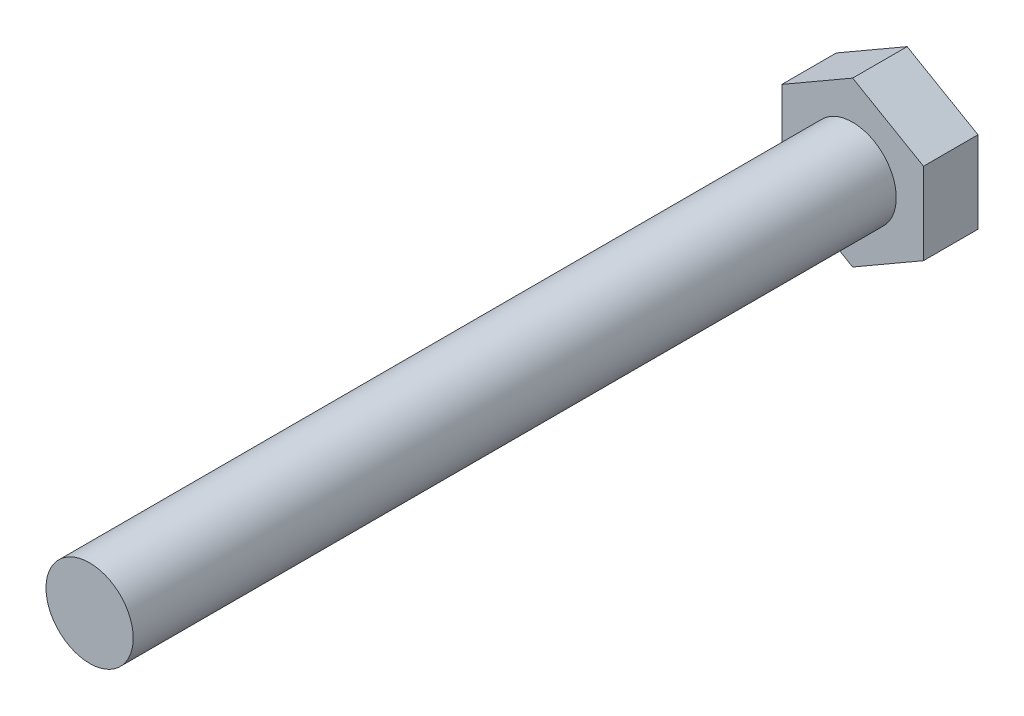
ISO-10303-21;
HEADER;
FILE_DESCRIPTION(('STEP AP214'),'2;1');
FILE_NAME('part.step','',(''),(''),'','','');
FILE_SCHEMA(('AUTOMOTIVE_DESIGN { 1 0 10303 214 1 1 1 1 }'));
ENDSEC;
DATA;
#1=APPLICATION_CONTEXT('core data for automotive mechanical design processes');
#2=APPLICATION_PROTOCOL_DEFINITION('international standard','automotive_design',2000,#1);
#3=PRODUCT_CONTEXT('',#1,'mechanical');
#4=PRODUCT('Part','Part','',(#3));
#5=PRODUCT_RELATED_PRODUCT_CATEGORY('part','',(#4));
#6=PRODUCT_DEFINITION_FORMATION('','',#4);
#7=PRODUCT_DEFINITION_CONTEXT('part definition',#1,'design');
#8=PRODUCT_DEFINITION('design','',#6,#7);
#9=PRODUCT_DEFINITION_SHAPE('','',#8);
#10=(LENGTH_UNIT() NAMED_UNIT(*) SI_UNIT(.MILLI.,.METRE.));
#11=(NAMED_UNIT(*) PLANE_ANGLE_UNIT() SI_UNIT($,.RADIAN.));
#12=(NAMED_UNIT(*) SI_UNIT($,.STERADIAN.) SOLID_ANGLE_UNIT());
#13=UNCERTAINTY_MEASURE_WITH_UNIT(LENGTH_MEASURE(1.E-05),#10,'distance_accuracy_value','');
#14=(GEOMETRIC_REPRESENTATION_CONTEXT(3) GLOBAL_UNCERTAINTY_ASSIGNED_CONTEXT((#13)) GLOBAL_UNIT_ASSIGNED_CONTEXT((#10,
#11,#12)) REPRESENTATION_CONTEXT('',''));
#15=CARTESIAN_POINT('',(0.,0.,0.));
#16=DIRECTION('',(0.,0.,1.));
#17=DIRECTION('',(1.,0.,0.));
#18=AXIS2_PLACEMENT_3D('',#15,#16,#17);
#19=CARTESIAN_POINT('',(0.,0.,70.));
#20=DIRECTION('',(0.,0.,-1.));
#21=DIRECTION('',(-1.,0.,0.));
#22=AXIS2_PLACEMENT_3D('',#19,#20,#21);
#23=CYLINDRICAL_SURFACE('',#22,4.);
#24=CARTESIAN_POINT('',(0.,0.,70.));
#25=DIRECTION('',(0.,0.,1.));
#26=DIRECTION('',(1.,0.,0.));
#27=AXIS2_PLACEMENT_3D('',#24,#25,#26);
#28=CIRCLE('',#27,4.);
#29=CARTESIAN_POINT('',(4.,0.,70.));
#30=VERTEX_POINT('',#29);
#31=EDGE_CURVE('E11',#30,#30,#28,.T.);
#32=ORIENTED_EDGE('',*,*,#31,.F.);
#33=EDGE_LOOP('',(#32));
#34=FACE_BOUND('',#33,.T.);
#35=CARTESIAN_POINT('',(0.,0.,0.));
#36=DIRECTION('',(0.,0.,-1.));
#37=DIRECTION('',(-1.,0.,0.));
#38=AXIS2_PLACEMENT_3D('',#35,#36,#37);
#39=CIRCLE('',#38,4.);
#40=CARTESIAN_POINT('',(-4.,0.,0.));
#41=VERTEX_POINT('',#40);
#42=EDGE_CURVE('E34',#41,#41,#39,.T.);
#43=ORIENTED_EDGE('',*,*,#42,.F.);
#44=EDGE_LOOP('',(#43));
#45=FACE_BOUND('',#44,.T.);
#46=ADVANCED_FACE('F27',(#34,#45),#23,.T.);
#47=CARTESIAN_POINT('',(0.,0.,70.));
#48=DIRECTION('',(0.,0.,1.));
#49=DIRECTION('',(1.,0.,0.));
#50=AXIS2_PLACEMENT_3D('',#47,#48,#49);
#51=PLANE('',#50);
#52=ORIENTED_EDGE('',*,*,#31,.T.);
#53=EDGE_LOOP('',(#52));
#54=FACE_BOUND('',#53,.T.);
#55=ADVANCED_FACE('F135',(#54),#51,.T.);
#56=CARTESIAN_POINT('',(0.,-7.50555349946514,0.));
#57=DIRECTION('',(0.,0.,-1.));
#58=DIRECTION('',(-1.,0.,0.));
#59=AXIS2_PLACEMENT_3D('',#56,#57,#58);
#60=PLANE('',#59);
#61=DIRECTION('',(-0.866025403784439,-0.5,0.));
#62=VECTOR('',#61,1.);
#63=CARTESIAN_POINT('',(6.5,-3.75277674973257,0.));
#64=LINE('',#63,#62);
#65=CARTESIAN_POINT('',(6.5,-3.75277674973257,0.));
#66=VERTEX_POINT('',#65);
#67=CARTESIAN_POINT('',(0.,-7.50555349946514,0.));
#68=VERTEX_POINT('',#67);
#69=EDGE_CURVE('E85',#66,#68,#64,.T.);
#70=ORIENTED_EDGE('',*,*,#69,.F.);
#71=DIRECTION('',(0.,-1.,0.));
#72=VECTOR('',#71,1.);
#73=CARTESIAN_POINT('',(6.5,3.75277674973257,0.));
#74=LINE('',#73,#72);
#75=CARTESIAN_POINT('',(6.5,3.75277674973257,0.));
#76=VERTEX_POINT('',#75);
#77=EDGE_CURVE('E110',#76,#66,#74,.T.);
#78=ORIENTED_EDGE('',*,*,#77,.F.);
#79=DIRECTION('',(0.866025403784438,-0.5,0.));
#80=VECTOR('',#79,1.);
#81=CARTESIAN_POINT('',(0.,7.50555349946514,0.));
#82=LINE('',#81,#80);
#83=CARTESIAN_POINT('',(0.,7.50555349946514,0.));
#84=VERTEX_POINT('',#83);
#85=EDGE_CURVE('E108',#84,#76,#82,.T.);
#86=ORIENTED_EDGE('',*,*,#85,.F.);
#87=DIRECTION('',(0.866025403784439,0.5,0.));
#88=VECTOR('',#87,1.);
#89=CARTESIAN_POINT('',(-6.5,3.75277674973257,0.));
#90=LINE('',#89,#88);
#91=CARTESIAN_POINT('',(-6.5,3.75277674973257,0.));
#92=VERTEX_POINT('',#91);
#93=EDGE_CURVE('E106',#92,#84,#90,.T.);
#94=ORIENTED_EDGE('',*,*,#93,.F.);
#95=DIRECTION('',(0.,1.,0.));
#96=VECTOR('',#95,1.);
#97=CARTESIAN_POINT('',(-6.5,-3.75277674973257,0.));
#98=LINE('',#97,#96);
#99=CARTESIAN_POINT('',(-6.5,-3.75277674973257,0.));
#100=VERTEX_POINT('',#99);
#101=EDGE_CURVE('E87',#100,#92,#98,.T.);
#102=ORIENTED_EDGE('',*,*,#101,.F.);
#103=DIRECTION('',(-0.866025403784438,0.5,0.));
#104=VECTOR('',#103,1.);
#105=CARTESIAN_POINT('',(0.,-7.50555349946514,0.));
#106=LINE('',#105,#104);
#107=EDGE_CURVE('E79',#68,#100,#106,.T.);
#108=ORIENTED_EDGE('',*,*,#107,.F.);
#109=EDGE_LOOP('',(#70,#78,#86,#94,#102,#108));
#110=FACE_BOUND('',#109,.T.);
#111=ORIENTED_EDGE('',*,*,#42,.T.);
#112=EDGE_LOOP('',(#111));
#113=FACE_BOUND('',#112,.T.);
#114=ADVANCED_FACE('F81',(#110,#113),#60,.F.);
#115=CARTESIAN_POINT('',(6.5,-3.75277674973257,-5.));
#116=DIRECTION('',(-0.5,0.866025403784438,0.));
#117=DIRECTION('',(-0.866025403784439,-0.5,0.));
#118=AXIS2_PLACEMENT_3D('',#115,#116,#117);
#119=PLANE('',#118);
#120=ORIENTED_EDGE('',*,*,#69,.T.);
#121=DIRECTION('',(0.,0.,1.));
#122=VECTOR('',#121,1.);
#123=CARTESIAN_POINT('',(0.,-7.50555349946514,-5.));
#124=LINE('',#123,#122);
#125=CARTESIAN_POINT('',(0.,-7.50555349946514,-5.));
#126=VERTEX_POINT('',#125);
#127=EDGE_CURVE('E93',#126,#68,#124,.T.);
#128=ORIENTED_EDGE('',*,*,#127,.F.);
#129=DIRECTION('',(-0.866025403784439,-0.5,0.));
#130=VECTOR('',#129,1.);
#131=CARTESIAN_POINT('',(6.5,-3.75277674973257,-5.));
#132=LINE('',#131,#130);
#133=CARTESIAN_POINT('',(6.5,-3.75277674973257,-5.));
#134=VERTEX_POINT('',#133);
#135=EDGE_CURVE('E112',#134,#126,#132,.T.);
#136=ORIENTED_EDGE('',*,*,#135,.F.);
#137=DIRECTION('',(0.,0.,1.));
#138=VECTOR('',#137,1.);
#139=CARTESIAN_POINT('',(6.5,-3.75277674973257,-5.));
#140=LINE('',#139,#138);
#141=EDGE_CURVE('E102',#134,#66,#140,.T.);
#142=ORIENTED_EDGE('',*,*,#141,.T.);
#143=EDGE_LOOP('',(#120,#128,#136,#142));
#144=FACE_BOUND('',#143,.T.);
#145=ADVANCED_FACE('F101',(#144),#119,.F.);
#146=CARTESIAN_POINT('',(0.,-7.50555349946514,-5.));
#147=DIRECTION('',(0.5,0.866025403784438,0.));
#148=DIRECTION('',(-0.866025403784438,0.5,0.));
#149=AXIS2_PLACEMENT_3D('',#146,#147,#148);
#150=PLANE('',#149);
#151=ORIENTED_EDGE('',*,*,#107,.T.);
#152=DIRECTION('',(0.,0.,1.));
#153=VECTOR('',#152,1.);
#154=CARTESIAN_POINT('',(-6.5,-3.75277674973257,-5.));
#155=LINE('',#154,#153);
#156=CARTESIAN_POINT('',(-6.5,-3.75277674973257,-5.));
#157=VERTEX_POINT('',#156);
#158=EDGE_CURVE('E98',#157,#100,#155,.T.);
#159=ORIENTED_EDGE('',*,*,#158,.F.);
#160=DIRECTION('',(-0.866025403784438,0.5,0.));
#161=VECTOR('',#160,1.);
#162=CARTESIAN_POINT('',(0.,-7.50555349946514,-5.));
#163=LINE('',#162,#161);
#164=EDGE_CURVE('E95',#126,#157,#163,.T.);
#165=ORIENTED_EDGE('',*,*,#164,.F.);
#166=ORIENTED_EDGE('',*,*,#127,.T.);
#167=EDGE_LOOP('',(#151,#159,#165,#166));
#168=FACE_BOUND('',#167,.T.);
#169=ADVANCED_FACE('F94',(#168),#150,.F.);
#170=CARTESIAN_POINT('',(-6.5,-3.75277674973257,-5.));
#171=DIRECTION('',(1.,0.,0.));
#172=DIRECTION('',(0.,1.,0.));
#173=AXIS2_PLACEMENT_3D('',#170,#171,#172);
#174=PLANE('',#173);
#175=ORIENTED_EDGE('',*,*,#101,.T.);
#176=DIRECTION('',(0.,0.,1.));
#177=VECTOR('',#176,1.);
#178=CARTESIAN_POINT('',(-6.5,3.75277674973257,-5.));
#179=LINE('',#178,#177);
#180=CARTESIAN_POINT('',(-6.5,3.75277674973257,-5.));
#181=VERTEX_POINT('',#180);
#182=EDGE_CURVE('E128',#181,#92,#179,.T.);
#183=ORIENTED_EDGE('',*,*,#182,.F.);
#184=DIRECTION('',(0.,1.,0.));
#185=VECTOR('',#184,1.);
#186=CARTESIAN_POINT('',(-6.5,-3.75277674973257,-5.));
#187=LINE('',#186,#185);
#188=EDGE_CURVE('E115',#157,#181,#187,.T.);
#189=ORIENTED_EDGE('',*,*,#188,.F.);
#190=ORIENTED_EDGE('',*,*,#158,.T.);
#191=EDGE_LOOP('',(#175,#183,#189,#190));
#192=FACE_BOUND('',#191,.T.);
#193=ADVANCED_FACE('F151',(#192),#174,.F.);
#194=CARTESIAN_POINT('',(-6.5,3.75277674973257,-5.));
#195=DIRECTION('',(0.5,-0.866025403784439,0.));
#196=DIRECTION('',(0.866025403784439,0.5,0.));
#197=AXIS2_PLACEMENT_3D('',#194,#195,#196);
#198=PLANE('',#197);
#199=ORIENTED_EDGE('',*,*,#93,.T.);
#200=DIRECTION('',(0.,0.,1.));
#201=VECTOR('',#200,1.);
#202=CARTESIAN_POINT('',(0.,7.50555349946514,-5.));
#203=LINE('',#202,#201);
#204=CARTESIAN_POINT('',(0.,7.50555349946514,-5.));
#205=VERTEX_POINT('',#204);
#206=EDGE_CURVE('E125',#205,#84,#203,.T.);
#207=ORIENTED_EDGE('',*,*,#206,.F.);
#208=DIRECTION('',(0.866025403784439,0.5,0.));
#209=VECTOR('',#208,1.);
#210=CARTESIAN_POINT('',(-6.5,3.75277674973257,-5.));
#211=LINE('',#210,#209);
#212=EDGE_CURVE('E117',#181,#205,#211,.T.);
#213=ORIENTED_EDGE('',*,*,#212,.F.);
#214=ORIENTED_EDGE('',*,*,#182,.T.);
#215=EDGE_LOOP('',(#199,#207,#213,#214));
#216=FACE_BOUND('',#215,.T.);
#217=ADVANCED_FACE('F154',(#216),#198,.F.);
#218=CARTESIAN_POINT('',(0.,7.50555349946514,-5.));
#219=DIRECTION('',(-0.5,-0.866025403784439,0.));
#220=DIRECTION('',(0.866025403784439,-0.5,0.));
#221=AXIS2_PLACEMENT_3D('',#218,#219,#220);
#222=PLANE('',#221);
#223=ORIENTED_EDGE('',*,*,#85,.T.);
#224=DIRECTION('',(0.,0.,1.));
#225=VECTOR('',#224,1.);
#226=CARTESIAN_POINT('',(6.5,3.75277674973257,-5.));
#227=LINE('',#226,#225);
#228=CARTESIAN_POINT('',(6.5,3.75277674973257,-5.));
#229=VERTEX_POINT('',#228);
#230=EDGE_CURVE('E122',#229,#76,#227,.T.);
#231=ORIENTED_EDGE('',*,*,#230,.F.);
#232=DIRECTION('',(0.866025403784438,-0.5,0.));
#233=VECTOR('',#232,1.);
#234=CARTESIAN_POINT('',(0.,7.50555349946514,-5.));
#235=LINE('',#234,#233);
#236=EDGE_CURVE('E46',#205,#229,#235,.T.);
#237=ORIENTED_EDGE('',*,*,#236,.F.);
#238=ORIENTED_EDGE('',*,*,#206,.T.);
#239=EDGE_LOOP('',(#223,#231,#237,#238));
#240=FACE_BOUND('',#239,.T.);
#241=ADVANCED_FACE('F158',(#240),#222,.F.);
#242=CARTESIAN_POINT('',(6.5,3.75277674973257,-5.));
#243=DIRECTION('',(-1.,0.,0.));
#244=DIRECTION('',(0.,-1.,0.));
#245=AXIS2_PLACEMENT_3D('',#242,#243,#244);
#246=PLANE('',#245);
#247=ORIENTED_EDGE('',*,*,#77,.T.);
#248=ORIENTED_EDGE('',*,*,#141,.F.);
#249=DIRECTION('',(0.,-1.,0.));
#250=VECTOR('',#249,1.);
#251=CARTESIAN_POINT('',(6.5,3.75277674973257,-5.));
#252=LINE('',#251,#250);
#253=EDGE_CURVE('E41',#229,#134,#252,.T.);
#254=ORIENTED_EDGE('',*,*,#253,.F.);
#255=ORIENTED_EDGE('',*,*,#230,.T.);
#256=EDGE_LOOP('',(#247,#248,#254,#255));
#257=FACE_BOUND('',#256,.T.);
#258=ADVANCED_FACE('F162',(#257),#246,.F.);
#259=CARTESIAN_POINT('',(0.,-7.50555349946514,-5.));
#260=DIRECTION('',(0.,0.,-1.));
#261=DIRECTION('',(-1.,0.,0.));
#262=AXIS2_PLACEMENT_3D('',#259,#260,#261);
#263=PLANE('',#262);
#264=ORIENTED_EDGE('',*,*,#135,.T.);
#265=ORIENTED_EDGE('',*,*,#164,.T.);
#266=ORIENTED_EDGE('',*,*,#188,.T.);
#267=ORIENTED_EDGE('',*,*,#212,.T.);
#268=ORIENTED_EDGE('',*,*,#236,.T.);
#269=ORIENTED_EDGE('',*,*,#253,.T.);
#270=EDGE_LOOP('',(#264,#265,#266,#267,#268,#269));
#271=FACE_BOUND('',#270,.T.);
#272=ADVANCED_FACE('F166',(#271),#263,.T.);
#273=CLOSED_SHELL('',(#46,#55,#114,#145,#169,#193,#217,#241,#258,#272));
#274=MANIFOLD_SOLID_BREP('B2',#273);
#275=ADVANCED_BREP_SHAPE_REPRESENTATION('',(#18,#274),#14);
#276=SHAPE_DEFINITION_REPRESENTATION(#9,#275);
ENDSEC;
END-ISO-10303-21;
